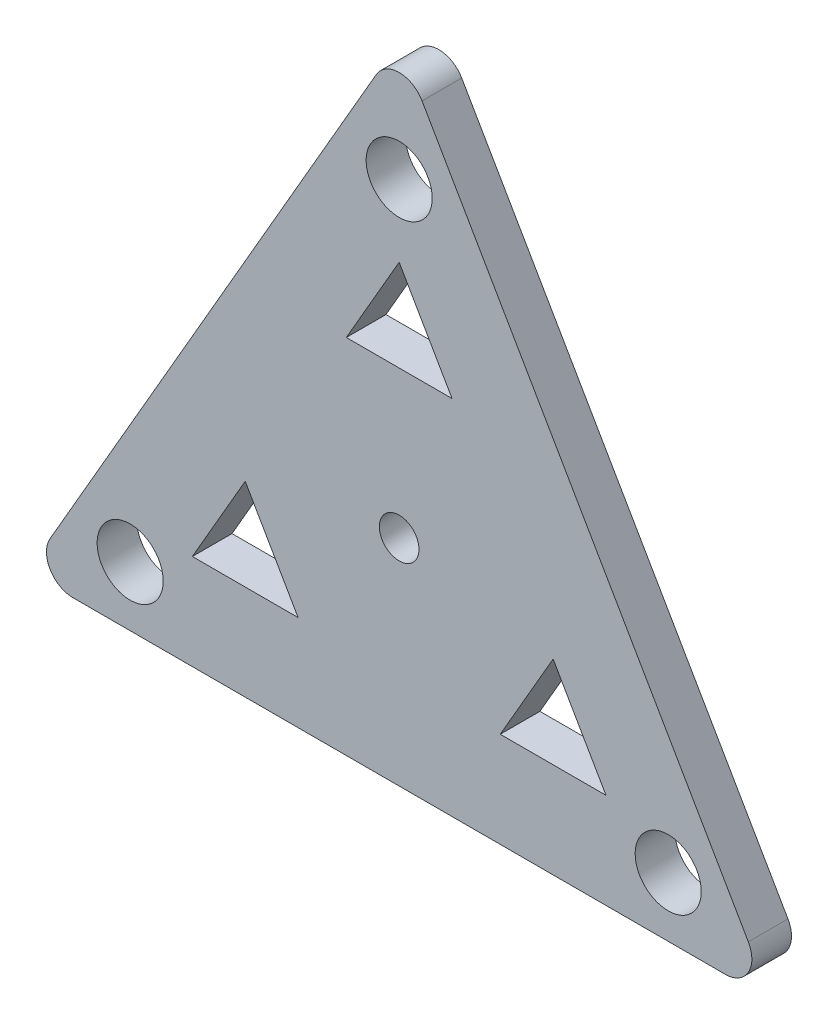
ISO-10303-21;
HEADER;
FILE_DESCRIPTION(('STEP AP214'),'2;1');
FILE_NAME('part.step','',(''),(''),'','','');
FILE_SCHEMA(('AUTOMOTIVE_DESIGN { 1 0 10303 214 1 1 1 1 }'));
ENDSEC;
DATA;
#1=APPLICATION_CONTEXT('core data for automotive mechanical design processes');
#2=APPLICATION_PROTOCOL_DEFINITION('international standard','automotive_design',2000,#1);
#3=PRODUCT_CONTEXT('',#1,'mechanical');
#4=PRODUCT('Part','Part','',(#3));
#5=PRODUCT_RELATED_PRODUCT_CATEGORY('part','',(#4));
#6=PRODUCT_DEFINITION_FORMATION('','',#4);
#7=PRODUCT_DEFINITION_CONTEXT('part definition',#1,'design');
#8=PRODUCT_DEFINITION('design','',#6,#7);
#9=PRODUCT_DEFINITION_SHAPE('','',#8);
#10=(LENGTH_UNIT() NAMED_UNIT(*) SI_UNIT(.MILLI.,.METRE.));
#11=(NAMED_UNIT(*) PLANE_ANGLE_UNIT() SI_UNIT($,.RADIAN.));
#12=(NAMED_UNIT(*) SI_UNIT($,.STERADIAN.) SOLID_ANGLE_UNIT());
#13=UNCERTAINTY_MEASURE_WITH_UNIT(LENGTH_MEASURE(1.E-05),#10,'distance_accuracy_value','');
#14=(GEOMETRIC_REPRESENTATION_CONTEXT(3) GLOBAL_UNCERTAINTY_ASSIGNED_CONTEXT((#13)) GLOBAL_UNIT_ASSIGNED_CONTEXT((#10,
#11,#12)) REPRESENTATION_CONTEXT('',''));
#15=CARTESIAN_POINT('',(0.,0.,0.));
#16=DIRECTION('',(0.,0.,1.));
#17=DIRECTION('',(1.,0.,0.));
#18=AXIS2_PLACEMENT_3D('',#15,#16,#17);
#19=CARTESIAN_POINT('',(28.1458256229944,-16.2500000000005,3.));
#20=DIRECTION('',(-0.866025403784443,-0.499999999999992,0.));
#21=DIRECTION('',(0.499999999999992,-0.866025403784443,0.));
#22=AXIS2_PLACEMENT_3D('',#19,#20,#21);
#23=PLANE('',#22);
#24=DIRECTION('',(-0.499999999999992,0.866025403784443,0.));
#25=VECTOR('',#24,1.);
#26=CARTESIAN_POINT('',(28.1458256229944,-16.2500000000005,3.));
#27=LINE('',#26,#25);
#28=CARTESIAN_POINT('',(26.4137748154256,-13.2500000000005,3.));
#29=VERTEX_POINT('',#28);
#30=CARTESIAN_POINT('',(1.73205080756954,29.4999999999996,3.));
#31=VERTEX_POINT('',#30);
#32=EDGE_CURVE('E245',#29,#31,#27,.T.);
#33=ORIENTED_EDGE('',*,*,#32,.F.);
#34=DIRECTION('',(0.,0.,-1.));
#35=VECTOR('',#34,1.);
#36=CARTESIAN_POINT('',(26.4137748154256,-13.2500000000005,3.));
#37=LINE('',#36,#35);
#38=CARTESIAN_POINT('',(26.4137748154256,-13.2500000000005,0.));
#39=VERTEX_POINT('',#38);
#40=EDGE_CURVE('E264',#29,#39,#37,.T.);
#41=ORIENTED_EDGE('',*,*,#40,.T.);
#42=DIRECTION('',(-0.499999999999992,0.866025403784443,0.));
#43=VECTOR('',#42,1.);
#44=CARTESIAN_POINT('',(28.1458256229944,-16.2500000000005,0.));
#45=LINE('',#44,#43);
#46=CARTESIAN_POINT('',(1.73205080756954,29.4999999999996,0.));
#47=VERTEX_POINT('',#46);
#48=EDGE_CURVE('E230',#39,#47,#45,.T.);
#49=ORIENTED_EDGE('',*,*,#48,.T.);
#50=DIRECTION('',(0.,0.,-1.));
#51=VECTOR('',#50,1.);
#52=CARTESIAN_POINT('',(1.73205080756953,29.4999999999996,3.));
#53=LINE('',#52,#51);
#54=EDGE_CURVE('E255',#47,#31,#53,.F.);
#55=ORIENTED_EDGE('',*,*,#54,.T.);
#56=EDGE_LOOP('',(#33,#41,#49,#55));
#57=FACE_BOUND('',#56,.T.);
#58=ADVANCED_FACE('F41',(#57),#23,.F.);
#59=CARTESIAN_POINT('',(6.74313992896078E-13,32.4999999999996,3.));
#60=DIRECTION('',(0.866025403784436,-0.500000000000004,0.));
#61=DIRECTION('',(0.500000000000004,0.866025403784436,0.));
#62=AXIS2_PLACEMENT_3D('',#59,#60,#61);
#63=PLANE('',#62);
#64=DIRECTION('',(-0.500000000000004,-0.866025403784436,0.));
#65=VECTOR('',#64,1.);
#66=CARTESIAN_POINT('',(6.74313992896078E-13,32.4999999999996,0.));
#67=LINE('',#66,#65);
#68=CARTESIAN_POINT('',(-1.73205080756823,29.4999999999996,0.));
#69=VERTEX_POINT('',#68);
#70=CARTESIAN_POINT('',(-26.4137748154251,-13.2500000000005,0.));
#71=VERTEX_POINT('',#70);
#72=EDGE_CURVE('E258',#69,#71,#67,.T.);
#73=ORIENTED_EDGE('',*,*,#72,.T.);
#74=DIRECTION('',(0.,0.,-1.));
#75=VECTOR('',#74,1.);
#76=CARTESIAN_POINT('',(-26.4137748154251,-13.2500000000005,3.));
#77=LINE('',#76,#75);
#78=CARTESIAN_POINT('',(-26.4137748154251,-13.2500000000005,3.));
#79=VERTEX_POINT('',#78);
#80=EDGE_CURVE('E11',#71,#79,#77,.F.);
#81=ORIENTED_EDGE('',*,*,#80,.T.);
#82=DIRECTION('',(-0.500000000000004,-0.866025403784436,0.));
#83=VECTOR('',#82,1.);
#84=CARTESIAN_POINT('',(6.74313992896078E-13,32.4999999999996,3.));
#85=LINE('',#84,#83);
#86=CARTESIAN_POINT('',(-1.73205080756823,29.4999999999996,3.));
#87=VERTEX_POINT('',#86);
#88=EDGE_CURVE('E248',#87,#79,#85,.T.);
#89=ORIENTED_EDGE('',*,*,#88,.F.);
#90=DIRECTION('',(0.,0.,-1.));
#91=VECTOR('',#90,1.);
#92=CARTESIAN_POINT('',(-1.73205080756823,29.4999999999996,3.));
#93=LINE('',#92,#91);
#94=EDGE_CURVE('E50',#87,#69,#93,.T.);
#95=ORIENTED_EDGE('',*,*,#94,.T.);
#96=EDGE_LOOP('',(#73,#81,#89,#95));
#97=FACE_BOUND('',#96,.T.);
#98=ADVANCED_FACE('F289',(#97),#63,.F.);
#99=CARTESIAN_POINT('',(-28.145825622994,-16.2500000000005,3.));
#100=DIRECTION('',(0.,1.,0.));
#101=DIRECTION('',(0.,0.,1.));
#102=AXIS2_PLACEMENT_3D('',#99,#100,#101);
#103=PLANE('',#102);
#104=DIRECTION('',(1.,0.,0.));
#105=VECTOR('',#104,1.);
#106=CARTESIAN_POINT('',(-28.145825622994,-16.2500000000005,0.));
#107=LINE('',#106,#105);
#108=CARTESIAN_POINT('',(-24.6817240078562,-16.2500000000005,0.));
#109=VERTEX_POINT('',#108);
#110=CARTESIAN_POINT('',(24.6817240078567,-16.2500000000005,0.));
#111=VERTEX_POINT('',#110);
#112=EDGE_CURVE('E249',#109,#111,#107,.T.);
#113=ORIENTED_EDGE('',*,*,#112,.T.);
#114=DIRECTION('',(0.,0.,-1.));
#115=VECTOR('',#114,1.);
#116=CARTESIAN_POINT('',(24.6817240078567,-16.2500000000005,3.));
#117=LINE('',#116,#115);
#118=CARTESIAN_POINT('',(24.6817240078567,-16.2500000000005,3.));
#119=VERTEX_POINT('',#118);
#120=EDGE_CURVE('E276',#111,#119,#117,.F.);
#121=ORIENTED_EDGE('',*,*,#120,.T.);
#122=DIRECTION('',(1.,0.,0.));
#123=VECTOR('',#122,1.);
#124=CARTESIAN_POINT('',(-28.145825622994,-16.2500000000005,3.));
#125=LINE('',#124,#123);
#126=CARTESIAN_POINT('',(-24.6817240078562,-16.2500000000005,3.));
#127=VERTEX_POINT('',#126);
#128=EDGE_CURVE('E252',#127,#119,#125,.T.);
#129=ORIENTED_EDGE('',*,*,#128,.F.);
#130=DIRECTION('',(0.,0.,-1.));
#131=VECTOR('',#130,1.);
#132=CARTESIAN_POINT('',(-24.6817240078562,-16.2500000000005,3.));
#133=LINE('',#132,#131);
#134=EDGE_CURVE('E273',#127,#109,#133,.T.);
#135=ORIENTED_EDGE('',*,*,#134,.T.);
#136=EDGE_LOOP('',(#113,#121,#129,#135));
#137=FACE_BOUND('',#136,.T.);
#138=ADVANCED_FACE('F302',(#137),#103,.F.);
#139=CARTESIAN_POINT('',(0.,0.,3.));
#140=DIRECTION('',(0.,0.,1.));
#141=DIRECTION('',(1.,0.,0.));
#142=AXIS2_PLACEMENT_3D('',#139,#140,#141);
#143=PLANE('',#142);
#144=CARTESIAN_POINT('',(0.,0.,3.));
#145=DIRECTION('',(0.,0.,1.));
#146=DIRECTION('',(1.,0.,0.));
#147=AXIS2_PLACEMENT_3D('',#144,#145,#146);
#148=CIRCLE('',#147,1.5);
#149=CARTESIAN_POINT('',(1.5,0.,3.));
#150=VERTEX_POINT('',#149);
#151=EDGE_CURVE('E172',#150,#150,#148,.T.);
#152=ORIENTED_EDGE('',*,*,#151,.F.);
#153=EDGE_LOOP('',(#152));
#154=FACE_BOUND('',#153,.T.);
#155=DIRECTION('',(-0.500000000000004,0.866025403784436,0.));
#156=VECTOR('',#155,1.);
#157=CARTESIAN_POINT('',(4.,11.1390432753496,3.));
#158=LINE('',#157,#156);
#159=CARTESIAN_POINT('',(4.,11.1390432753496,3.));
#160=VERTEX_POINT('',#159);
#161=CARTESIAN_POINT('',(0.,18.067246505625,3.));
#162=VERTEX_POINT('',#161);
#163=EDGE_CURVE('E57',#160,#162,#158,.T.);
#164=ORIENTED_EDGE('',*,*,#163,.F.);
#165=DIRECTION('',(1.,0.,0.));
#166=VECTOR('',#165,1.);
#167=CARTESIAN_POINT('',(-4.,11.1390432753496,3.));
#168=LINE('',#167,#166);
#169=CARTESIAN_POINT('',(-4.,11.1390432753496,3.));
#170=VERTEX_POINT('',#169);
#171=EDGE_CURVE('E166',#170,#160,#168,.T.);
#172=ORIENTED_EDGE('',*,*,#171,.F.);
#173=DIRECTION('',(-0.500000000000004,-0.866025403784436,0.));
#174=VECTOR('',#173,1.);
#175=CARTESIAN_POINT('',(0.,18.067246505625,3.));
#176=LINE('',#175,#174);
#177=EDGE_CURVE('E169',#162,#170,#176,.T.);
#178=ORIENTED_EDGE('',*,*,#177,.F.);
#179=EDGE_LOOP('',(#164,#172,#178));
#180=FACE_BOUND('',#179,.T.);
#181=DIRECTION('',(-0.499999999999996,-0.866025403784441,0.));
#182=VECTOR('',#181,1.);
#183=CARTESIAN_POINT('',(-15.6466944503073,-9.03362325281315,3.));
#184=LINE('',#183,#182);
#185=CARTESIAN_POINT('',(-11.6466944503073,-2.10542002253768,3.));
#186=VERTEX_POINT('',#185);
#187=CARTESIAN_POINT('',(-15.6466944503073,-9.03362325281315,3.));
#188=VERTEX_POINT('',#187);
#189=EDGE_CURVE('E65',#186,#188,#184,.T.);
#190=ORIENTED_EDGE('',*,*,#189,.F.);
#191=DIRECTION('',(-0.5,0.866025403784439,0.));
#192=VECTOR('',#191,1.);
#193=CARTESIAN_POINT('',(-11.6466944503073,-2.10542002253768,3.));
#194=LINE('',#193,#192);
#195=CARTESIAN_POINT('',(-7.64669445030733,-9.03362325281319,3.));
#196=VERTEX_POINT('',#195);
#197=EDGE_CURVE('E189',#196,#186,#194,.T.);
#198=ORIENTED_EDGE('',*,*,#197,.F.);
#199=DIRECTION('',(1.,0.,0.));
#200=VECTOR('',#199,1.);
#201=CARTESIAN_POINT('',(-7.64669445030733,-9.03362325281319,3.));
#202=LINE('',#201,#200);
#203=EDGE_CURVE('E192',#188,#196,#202,.T.);
#204=ORIENTED_EDGE('',*,*,#203,.F.);
#205=EDGE_LOOP('',(#190,#198,#204));
#206=FACE_BOUND('',#205,.T.);
#207=DIRECTION('',(1.,0.,0.));
#208=VECTOR('',#207,1.);
#209=CARTESIAN_POINT('',(15.6466944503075,-9.03362325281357,3.));
#210=LINE('',#209,#208);
#211=CARTESIAN_POINT('',(7.64669445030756,-9.03362325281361,3.));
#212=VERTEX_POINT('',#211);
#213=CARTESIAN_POINT('',(15.6466944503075,-9.03362325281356,3.));
#214=VERTEX_POINT('',#213);
#215=EDGE_CURVE('E188',#212,#214,#210,.T.);
#216=ORIENTED_EDGE('',*,*,#215,.F.);
#217=DIRECTION('',(-0.5,-0.866025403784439,0.));
#218=VECTOR('',#217,1.);
#219=CARTESIAN_POINT('',(7.64669445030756,-9.03362325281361,3.));
#220=LINE('',#219,#218);
#221=CARTESIAN_POINT('',(11.6466944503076,-2.1054200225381,3.));
#222=VERTEX_POINT('',#221);
#223=EDGE_CURVE('E212',#222,#212,#220,.T.);
#224=ORIENTED_EDGE('',*,*,#223,.F.);
#225=DIRECTION('',(-0.499999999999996,0.866025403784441,0.));
#226=VECTOR('',#225,1.);
#227=CARTESIAN_POINT('',(11.6466944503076,-2.1054200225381,3.));
#228=LINE('',#227,#226);
#229=EDGE_CURVE('E215',#214,#222,#228,.T.);
#230=ORIENTED_EDGE('',*,*,#229,.F.);
#231=EDGE_LOOP('',(#216,#224,#230));
#232=FACE_BOUND('',#231,.T.);
#233=CARTESIAN_POINT('',(0.,23.5,3.));
#234=DIRECTION('',(0.,0.,1.));
#235=DIRECTION('',(1.,0.,0.));
#236=AXIS2_PLACEMENT_3D('',#233,#234,#235);
#237=CIRCLE('',#236,2.5);
#238=CARTESIAN_POINT('',(2.5,23.5,3.));
#239=VERTEX_POINT('',#238);
#240=EDGE_CURVE('E231',#239,#239,#237,.T.);
#241=ORIENTED_EDGE('',*,*,#240,.F.);
#242=EDGE_LOOP('',(#241));
#243=FACE_BOUND('',#242,.T.);
#244=CARTESIAN_POINT('',(-20.3515969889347,-11.7500000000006,3.));
#245=DIRECTION('',(0.,0.,1.));
#246=DIRECTION('',(-1.,0.,0.));
#247=AXIS2_PLACEMENT_3D('',#244,#245,#246);
#248=CIRCLE('',#247,2.49999999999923);
#249=CARTESIAN_POINT('',(-22.8515969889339,-11.7500000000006,3.));
#250=VERTEX_POINT('',#249);
#251=EDGE_CURVE('E234',#250,#250,#248,.T.);
#252=ORIENTED_EDGE('',*,*,#251,.F.);
#253=EDGE_LOOP('',(#252));
#254=FACE_BOUND('',#253,.T.);
#255=CARTESIAN_POINT('',(20.3515969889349,-11.750000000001,3.));
#256=DIRECTION('',(0.,0.,1.));
#257=DIRECTION('',(-1.,0.,0.));
#258=AXIS2_PLACEMENT_3D('',#255,#256,#257);
#259=CIRCLE('',#258,2.49999999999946);
#260=CARTESIAN_POINT('',(17.8515969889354,-11.750000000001,3.));
#261=VERTEX_POINT('',#260);
#262=EDGE_CURVE('E240',#261,#261,#259,.T.);
#263=ORIENTED_EDGE('',*,*,#262,.F.);
#264=EDGE_LOOP('',(#263));
#265=FACE_BOUND('',#264,.T.);
#266=ORIENTED_EDGE('',*,*,#128,.T.);
#267=CARTESIAN_POINT('',(24.6817240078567,-14.2500000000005,3.));
#268=DIRECTION('',(0.,0.,1.));
#269=DIRECTION('',(1.,0.,0.));
#270=AXIS2_PLACEMENT_3D('',#267,#268,#269);
#271=CIRCLE('',#270,2.);
#272=EDGE_CURVE('E282',#119,#29,#271,.T.);
#273=ORIENTED_EDGE('',*,*,#272,.T.);
#274=ORIENTED_EDGE('',*,*,#32,.T.);
#275=CARTESIAN_POINT('',(6.41630845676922E-13,28.4999999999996,3.));
#276=DIRECTION('',(0.,0.,1.));
#277=DIRECTION('',(1.,0.,0.));
#278=AXIS2_PLACEMENT_3D('',#275,#276,#277);
#279=CIRCLE('',#278,2.);
#280=EDGE_CURVE('E278',#31,#87,#279,.T.);
#281=ORIENTED_EDGE('',*,*,#280,.T.);
#282=ORIENTED_EDGE('',*,*,#88,.T.);
#283=CARTESIAN_POINT('',(-24.6817240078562,-14.2500000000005,3.));
#284=DIRECTION('',(0.,0.,1.));
#285=DIRECTION('',(1.,0.,0.));
#286=AXIS2_PLACEMENT_3D('',#283,#284,#285);
#287=CIRCLE('',#286,2.);
#288=EDGE_CURVE('E280',#79,#127,#287,.T.);
#289=ORIENTED_EDGE('',*,*,#288,.T.);
#290=EDGE_LOOP('',(#266,#273,#274,#281,#282,#289));
#291=FACE_BOUND('',#290,.T.);
#292=ADVANCED_FACE('F306',(#154,#180,#206,#232,#243,#254,#265,#291),#143,.T.);
#293=CARTESIAN_POINT('',(0.,0.,0.));
#294=DIRECTION('',(0.,0.,1.));
#295=DIRECTION('',(1.,0.,0.));
#296=AXIS2_PLACEMENT_3D('',#293,#294,#295);
#297=PLANE('',#296);
#298=CARTESIAN_POINT('',(0.,0.,0.));
#299=DIRECTION('',(0.,0.,1.));
#300=DIRECTION('',(1.,0.,0.));
#301=AXIS2_PLACEMENT_3D('',#298,#299,#300);
#302=CIRCLE('',#301,1.5);
#303=CARTESIAN_POINT('',(1.5,0.,0.));
#304=VERTEX_POINT('',#303);
#305=EDGE_CURVE('E45',#304,#304,#302,.T.);
#306=ORIENTED_EDGE('',*,*,#305,.T.);
#307=EDGE_LOOP('',(#306));
#308=FACE_BOUND('',#307,.T.);
#309=DIRECTION('',(1.,0.,0.));
#310=VECTOR('',#309,1.);
#311=CARTESIAN_POINT('',(-4.,11.1390432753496,0.));
#312=LINE('',#311,#310);
#313=CARTESIAN_POINT('',(-4.,11.1390432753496,0.));
#314=VERTEX_POINT('',#313);
#315=CARTESIAN_POINT('',(4.,11.1390432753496,0.));
#316=VERTEX_POINT('',#315);
#317=EDGE_CURVE('E156',#314,#316,#312,.T.);
#318=ORIENTED_EDGE('',*,*,#317,.T.);
#319=DIRECTION('',(-0.500000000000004,0.866025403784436,0.));
#320=VECTOR('',#319,1.);
#321=CARTESIAN_POINT('',(4.,11.1390432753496,0.));
#322=LINE('',#321,#320);
#323=CARTESIAN_POINT('',(0.,18.067246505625,0.));
#324=VERTEX_POINT('',#323);
#325=EDGE_CURVE('E150',#316,#324,#322,.T.);
#326=ORIENTED_EDGE('',*,*,#325,.T.);
#327=DIRECTION('',(-0.500000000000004,-0.866025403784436,0.));
#328=VECTOR('',#327,1.);
#329=CARTESIAN_POINT('',(0.,18.067246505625,0.));
#330=LINE('',#329,#328);
#331=EDGE_CURVE('E160',#324,#314,#330,.T.);
#332=ORIENTED_EDGE('',*,*,#331,.T.);
#333=EDGE_LOOP('',(#318,#326,#332));
#334=FACE_BOUND('',#333,.T.);
#335=DIRECTION('',(-0.5,0.866025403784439,0.));
#336=VECTOR('',#335,1.);
#337=CARTESIAN_POINT('',(-11.6466944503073,-2.10542002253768,0.));
#338=LINE('',#337,#336);
#339=CARTESIAN_POINT('',(-7.64669445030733,-9.03362325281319,0.));
#340=VERTEX_POINT('',#339);
#341=CARTESIAN_POINT('',(-11.6466944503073,-2.10542002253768,0.));
#342=VERTEX_POINT('',#341);
#343=EDGE_CURVE('E183',#340,#342,#338,.T.);
#344=ORIENTED_EDGE('',*,*,#343,.T.);
#345=DIRECTION('',(-0.499999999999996,-0.866025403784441,0.));
#346=VECTOR('',#345,1.);
#347=CARTESIAN_POINT('',(-15.6466944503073,-9.03362325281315,0.));
#348=LINE('',#347,#346);
#349=CARTESIAN_POINT('',(-15.6466944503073,-9.03362325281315,0.));
#350=VERTEX_POINT('',#349);
#351=EDGE_CURVE('E193',#342,#350,#348,.T.);
#352=ORIENTED_EDGE('',*,*,#351,.T.);
#353=DIRECTION('',(1.,0.,0.));
#354=VECTOR('',#353,1.);
#355=CARTESIAN_POINT('',(-7.64669445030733,-9.03362325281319,0.));
#356=LINE('',#355,#354);
#357=EDGE_CURVE('E199',#350,#340,#356,.T.);
#358=ORIENTED_EDGE('',*,*,#357,.T.);
#359=EDGE_LOOP('',(#344,#352,#358));
#360=FACE_BOUND('',#359,.T.);
#361=DIRECTION('',(-0.5,-0.866025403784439,0.));
#362=VECTOR('',#361,1.);
#363=CARTESIAN_POINT('',(7.64669445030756,-9.03362325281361,0.));
#364=LINE('',#363,#362);
#365=CARTESIAN_POINT('',(11.6466944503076,-2.1054200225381,0.));
#366=VERTEX_POINT('',#365);
#367=CARTESIAN_POINT('',(7.64669445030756,-9.03362325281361,0.));
#368=VERTEX_POINT('',#367);
#369=EDGE_CURVE('E207',#366,#368,#364,.T.);
#370=ORIENTED_EDGE('',*,*,#369,.T.);
#371=DIRECTION('',(1.,0.,0.));
#372=VECTOR('',#371,1.);
#373=CARTESIAN_POINT('',(15.6466944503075,-9.03362325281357,0.));
#374=LINE('',#373,#372);
#375=CARTESIAN_POINT('',(15.6466944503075,-9.03362325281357,0.));
#376=VERTEX_POINT('',#375);
#377=EDGE_CURVE('E216',#368,#376,#374,.T.);
#378=ORIENTED_EDGE('',*,*,#377,.T.);
#379=DIRECTION('',(-0.499999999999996,0.866025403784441,0.));
#380=VECTOR('',#379,1.);
#381=CARTESIAN_POINT('',(11.6466944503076,-2.1054200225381,0.));
#382=LINE('',#381,#380);
#383=EDGE_CURVE('E222',#376,#366,#382,.T.);
#384=ORIENTED_EDGE('',*,*,#383,.T.);
#385=EDGE_LOOP('',(#370,#378,#384));
#386=FACE_BOUND('',#385,.T.);
#387=CARTESIAN_POINT('',(0.,23.5,0.));
#388=DIRECTION('',(0.,0.,1.));
#389=DIRECTION('',(1.,0.,0.));
#390=AXIS2_PLACEMENT_3D('',#387,#388,#389);
#391=CIRCLE('',#390,2.5);
#392=CARTESIAN_POINT('',(2.5,23.5,0.));
#393=VERTEX_POINT('',#392);
#394=EDGE_CURVE('E227',#393,#393,#391,.T.);
#395=ORIENTED_EDGE('',*,*,#394,.T.);
#396=EDGE_LOOP('',(#395));
#397=FACE_BOUND('',#396,.T.);
#398=CARTESIAN_POINT('',(-20.3515969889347,-11.7500000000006,0.));
#399=DIRECTION('',(0.,0.,1.));
#400=DIRECTION('',(-1.,0.,0.));
#401=AXIS2_PLACEMENT_3D('',#398,#399,#400);
#402=CIRCLE('',#401,2.49999999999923);
#403=CARTESIAN_POINT('',(-22.8515969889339,-11.7500000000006,0.));
#404=VERTEX_POINT('',#403);
#405=EDGE_CURVE('E237',#404,#404,#402,.T.);
#406=ORIENTED_EDGE('',*,*,#405,.T.);
#407=EDGE_LOOP('',(#406));
#408=FACE_BOUND('',#407,.T.);
#409=CARTESIAN_POINT('',(20.3515969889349,-11.750000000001,0.));
#410=DIRECTION('',(0.,0.,1.));
#411=DIRECTION('',(-1.,0.,0.));
#412=AXIS2_PLACEMENT_3D('',#409,#410,#411);
#413=CIRCLE('',#412,2.49999999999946);
#414=CARTESIAN_POINT('',(17.8515969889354,-11.750000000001,0.));
#415=VERTEX_POINT('',#414);
#416=EDGE_CURVE('E179',#415,#415,#413,.T.);
#417=ORIENTED_EDGE('',*,*,#416,.T.);
#418=EDGE_LOOP('',(#417));
#419=FACE_BOUND('',#418,.T.);
#420=ORIENTED_EDGE('',*,*,#48,.F.);
#421=CARTESIAN_POINT('',(24.6817240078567,-14.2500000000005,0.));
#422=DIRECTION('',(0.,0.,1.));
#423=DIRECTION('',(1.,0.,0.));
#424=AXIS2_PLACEMENT_3D('',#421,#422,#423);
#425=CIRCLE('',#424,2.);
#426=EDGE_CURVE('E271',#39,#111,#425,.F.);
#427=ORIENTED_EDGE('',*,*,#426,.T.);
#428=ORIENTED_EDGE('',*,*,#112,.F.);
#429=CARTESIAN_POINT('',(-24.6817240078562,-14.2500000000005,0.));
#430=DIRECTION('',(0.,0.,1.));
#431=DIRECTION('',(1.,0.,0.));
#432=AXIS2_PLACEMENT_3D('',#429,#430,#431);
#433=CIRCLE('',#432,2.);
#434=EDGE_CURVE('E269',#109,#71,#433,.F.);
#435=ORIENTED_EDGE('',*,*,#434,.T.);
#436=ORIENTED_EDGE('',*,*,#72,.F.);
#437=CARTESIAN_POINT('',(6.41630845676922E-13,28.4999999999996,0.));
#438=DIRECTION('',(0.,0.,1.));
#439=DIRECTION('',(1.,0.,0.));
#440=AXIS2_PLACEMENT_3D('',#437,#438,#439);
#441=CIRCLE('',#440,2.);
#442=EDGE_CURVE('E267',#69,#47,#441,.F.);
#443=ORIENTED_EDGE('',*,*,#442,.T.);
#444=EDGE_LOOP('',(#420,#427,#428,#435,#436,#443));
#445=FACE_BOUND('',#444,.T.);
#446=ADVANCED_FACE('F164',(#308,#334,#360,#386,#397,#408,#419,#445),#297,.F.);
#447=CARTESIAN_POINT('',(24.6817240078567,-14.2500000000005,3.));
#448=DIRECTION('',(0.,0.,-1.));
#449=DIRECTION('',(-1.,0.,0.));
#450=AXIS2_PLACEMENT_3D('',#447,#448,#449);
#451=CYLINDRICAL_SURFACE('',#450,2.);
#452=ORIENTED_EDGE('',*,*,#272,.F.);
#453=ORIENTED_EDGE('',*,*,#120,.F.);
#454=ORIENTED_EDGE('',*,*,#426,.F.);
#455=ORIENTED_EDGE('',*,*,#40,.F.);
#456=EDGE_LOOP('',(#452,#453,#454,#455));
#457=FACE_BOUND('',#456,.T.);
#458=ADVANCED_FACE('F310',(#457),#451,.T.);
#459=CARTESIAN_POINT('',(-24.6817240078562,-14.2500000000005,3.));
#460=DIRECTION('',(0.,0.,-1.));
#461=DIRECTION('',(-1.,0.,0.));
#462=AXIS2_PLACEMENT_3D('',#459,#460,#461);
#463=CYLINDRICAL_SURFACE('',#462,2.);
#464=ORIENTED_EDGE('',*,*,#288,.F.);
#465=ORIENTED_EDGE('',*,*,#80,.F.);
#466=ORIENTED_EDGE('',*,*,#434,.F.);
#467=ORIENTED_EDGE('',*,*,#134,.F.);
#468=EDGE_LOOP('',(#464,#465,#466,#467));
#469=FACE_BOUND('',#468,.T.);
#470=ADVANCED_FACE('F299',(#469),#463,.T.);
#471=CARTESIAN_POINT('',(6.41630845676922E-13,28.4999999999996,3.));
#472=DIRECTION('',(0.,0.,-1.));
#473=DIRECTION('',(-1.,0.,0.));
#474=AXIS2_PLACEMENT_3D('',#471,#472,#473);
#475=CYLINDRICAL_SURFACE('',#474,2.);
#476=ORIENTED_EDGE('',*,*,#280,.F.);
#477=ORIENTED_EDGE('',*,*,#54,.F.);
#478=ORIENTED_EDGE('',*,*,#442,.F.);
#479=ORIENTED_EDGE('',*,*,#94,.F.);
#480=EDGE_LOOP('',(#476,#477,#478,#479));
#481=FACE_BOUND('',#480,.T.);
#482=ADVANCED_FACE('F43',(#481),#475,.T.);
#483=CARTESIAN_POINT('',(20.3515969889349,-11.750000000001,0.));
#484=DIRECTION('',(0.,0.,1.));
#485=DIRECTION('',(1.,0.,0.));
#486=AXIS2_PLACEMENT_3D('',#483,#484,#485);
#487=CYLINDRICAL_SURFACE('',#486,2.49999999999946);
#488=ORIENTED_EDGE('',*,*,#416,.F.);
#489=EDGE_LOOP('',(#488));
#490=FACE_BOUND('',#489,.T.);
#491=ORIENTED_EDGE('',*,*,#262,.T.);
#492=EDGE_LOOP('',(#491));
#493=FACE_BOUND('',#492,.T.);
#494=ADVANCED_FACE('F314',(#490,#493),#487,.F.);
#495=CARTESIAN_POINT('',(-20.3515969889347,-11.7500000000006,0.));
#496=DIRECTION('',(0.,0.,1.));
#497=DIRECTION('',(1.,0.,0.));
#498=AXIS2_PLACEMENT_3D('',#495,#496,#497);
#499=CYLINDRICAL_SURFACE('',#498,2.49999999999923);
#500=ORIENTED_EDGE('',*,*,#405,.F.);
#501=EDGE_LOOP('',(#500));
#502=FACE_BOUND('',#501,.T.);
#503=ORIENTED_EDGE('',*,*,#251,.T.);
#504=EDGE_LOOP('',(#503));
#505=FACE_BOUND('',#504,.T.);
#506=ADVANCED_FACE('F319',(#502,#505),#499,.F.);
#507=CARTESIAN_POINT('',(0.,23.5,0.));
#508=DIRECTION('',(0.,0.,1.));
#509=DIRECTION('',(1.,0.,0.));
#510=AXIS2_PLACEMENT_3D('',#507,#508,#509);
#511=CYLINDRICAL_SURFACE('',#510,2.5);
#512=ORIENTED_EDGE('',*,*,#394,.F.);
#513=EDGE_LOOP('',(#512));
#514=FACE_BOUND('',#513,.T.);
#515=ORIENTED_EDGE('',*,*,#240,.T.);
#516=EDGE_LOOP('',(#515));
#517=FACE_BOUND('',#516,.T.);
#518=ADVANCED_FACE('F392',(#514,#517),#511,.F.);
#519=CARTESIAN_POINT('',(15.6466944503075,-9.03362325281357,0.));
#520=DIRECTION('',(0.,-1.,0.));
#521=DIRECTION('',(1.,0.,0.));
#522=AXIS2_PLACEMENT_3D('',#519,#520,#521);
#523=PLANE('',#522);
#524=ORIENTED_EDGE('',*,*,#215,.T.);
#525=DIRECTION('',(0.,0.,1.));
#526=VECTOR('',#525,1.);
#527=CARTESIAN_POINT('',(15.6466944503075,-9.03362325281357,0.));
#528=LINE('',#527,#526);
#529=EDGE_CURVE('E204',#376,#214,#528,.T.);
#530=ORIENTED_EDGE('',*,*,#529,.F.);
#531=ORIENTED_EDGE('',*,*,#377,.F.);
#532=DIRECTION('',(0.,0.,1.));
#533=VECTOR('',#532,1.);
#534=CARTESIAN_POINT('',(7.64669445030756,-9.03362325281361,0.));
#535=LINE('',#534,#533);
#536=EDGE_CURVE('E210',#368,#212,#535,.T.);
#537=ORIENTED_EDGE('',*,*,#536,.T.);
#538=EDGE_LOOP('',(#524,#530,#531,#537));
#539=FACE_BOUND('',#538,.T.);
#540=ADVANCED_FACE('F401',(#539),#523,.F.);
#541=CARTESIAN_POINT('',(7.64669445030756,-9.03362325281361,0.));
#542=DIRECTION('',(-0.866025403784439,0.5,0.));
#543=DIRECTION('',(-0.5,-0.866025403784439,0.));
#544=AXIS2_PLACEMENT_3D('',#541,#542,#543);
#545=PLANE('',#544);
#546=ORIENTED_EDGE('',*,*,#223,.T.);
#547=ORIENTED_EDGE('',*,*,#536,.F.);
#548=ORIENTED_EDGE('',*,*,#369,.F.);
#549=DIRECTION('',(0.,0.,1.));
#550=VECTOR('',#549,1.);
#551=CARTESIAN_POINT('',(11.6466944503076,-2.1054200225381,0.));
#552=LINE('',#551,#550);
#553=EDGE_CURVE('E208',#366,#222,#552,.T.);
#554=ORIENTED_EDGE('',*,*,#553,.T.);
#555=EDGE_LOOP('',(#546,#547,#548,#554));
#556=FACE_BOUND('',#555,.T.);
#557=ADVANCED_FACE('F410',(#556),#545,.F.);
#558=CARTESIAN_POINT('',(11.6466944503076,-2.1054200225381,0.));
#559=DIRECTION('',(0.866025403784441,0.499999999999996,0.));
#560=DIRECTION('',(-0.499999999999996,0.866025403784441,0.));
#561=AXIS2_PLACEMENT_3D('',#558,#559,#560);
#562=PLANE('',#561);
#563=ORIENTED_EDGE('',*,*,#229,.T.);
#564=ORIENTED_EDGE('',*,*,#553,.F.);
#565=ORIENTED_EDGE('',*,*,#383,.F.);
#566=ORIENTED_EDGE('',*,*,#529,.T.);
#567=EDGE_LOOP('',(#563,#564,#565,#566));
#568=FACE_BOUND('',#567,.T.);
#569=ADVANCED_FACE('F419',(#568),#562,.F.);
#570=CARTESIAN_POINT('',(-15.6466944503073,-9.03362325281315,0.));
#571=DIRECTION('',(-0.866025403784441,0.499999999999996,0.));
#572=DIRECTION('',(-0.499999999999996,-0.866025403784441,0.));
#573=AXIS2_PLACEMENT_3D('',#570,#571,#572);
#574=PLANE('',#573);
#575=ORIENTED_EDGE('',*,*,#189,.T.);
#576=DIRECTION('',(0.,0.,1.));
#577=VECTOR('',#576,1.);
#578=CARTESIAN_POINT('',(-15.6466944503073,-9.03362325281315,0.));
#579=LINE('',#578,#577);
#580=EDGE_CURVE('E181',#350,#188,#579,.T.);
#581=ORIENTED_EDGE('',*,*,#580,.F.);
#582=ORIENTED_EDGE('',*,*,#351,.F.);
#583=DIRECTION('',(0.,0.,1.));
#584=VECTOR('',#583,1.);
#585=CARTESIAN_POINT('',(-11.6466944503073,-2.10542002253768,0.));
#586=LINE('',#585,#584);
#587=EDGE_CURVE('E186',#342,#186,#586,.T.);
#588=ORIENTED_EDGE('',*,*,#587,.T.);
#589=EDGE_LOOP('',(#575,#581,#582,#588));
#590=FACE_BOUND('',#589,.T.);
#591=ADVANCED_FACE('F428',(#590),#574,.F.);
#592=CARTESIAN_POINT('',(-11.6466944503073,-2.10542002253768,0.));
#593=DIRECTION('',(0.866025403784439,0.5,0.));
#594=DIRECTION('',(-0.5,0.866025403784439,0.));
#595=AXIS2_PLACEMENT_3D('',#592,#593,#594);
#596=PLANE('',#595);
#597=ORIENTED_EDGE('',*,*,#197,.T.);
#598=ORIENTED_EDGE('',*,*,#587,.F.);
#599=ORIENTED_EDGE('',*,*,#343,.F.);
#600=DIRECTION('',(0.,0.,1.));
#601=VECTOR('',#600,1.);
#602=CARTESIAN_POINT('',(-7.64669445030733,-9.03362325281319,0.));
#603=LINE('',#602,#601);
#604=EDGE_CURVE('E184',#340,#196,#603,.T.);
#605=ORIENTED_EDGE('',*,*,#604,.T.);
#606=EDGE_LOOP('',(#597,#598,#599,#605));
#607=FACE_BOUND('',#606,.T.);
#608=ADVANCED_FACE('F437',(#607),#596,.F.);
#609=CARTESIAN_POINT('',(-7.64669445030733,-9.03362325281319,0.));
#610=DIRECTION('',(0.,-1.,0.));
#611=DIRECTION('',(1.,0.,0.));
#612=AXIS2_PLACEMENT_3D('',#609,#610,#611);
#613=PLANE('',#612);
#614=ORIENTED_EDGE('',*,*,#203,.T.);
#615=ORIENTED_EDGE('',*,*,#604,.F.);
#616=ORIENTED_EDGE('',*,*,#357,.F.);
#617=ORIENTED_EDGE('',*,*,#580,.T.);
#618=EDGE_LOOP('',(#614,#615,#616,#617));
#619=FACE_BOUND('',#618,.T.);
#620=ADVANCED_FACE('F445',(#619),#613,.F.);
#621=CARTESIAN_POINT('',(4.,11.1390432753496,0.));
#622=DIRECTION('',(0.866025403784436,0.500000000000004,0.));
#623=DIRECTION('',(-0.500000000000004,0.866025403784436,0.));
#624=AXIS2_PLACEMENT_3D('',#621,#622,#623);
#625=PLANE('',#624);
#626=ORIENTED_EDGE('',*,*,#163,.T.);
#627=DIRECTION('',(0.,0.,1.));
#628=VECTOR('',#627,1.);
#629=CARTESIAN_POINT('',(0.,18.067246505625,0.));
#630=LINE('',#629,#628);
#631=EDGE_CURVE('E146',#324,#162,#630,.T.);
#632=ORIENTED_EDGE('',*,*,#631,.F.);
#633=ORIENTED_EDGE('',*,*,#325,.F.);
#634=DIRECTION('',(0.,0.,1.));
#635=VECTOR('',#634,1.);
#636=CARTESIAN_POINT('',(4.,11.1390432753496,0.));
#637=LINE('',#636,#635);
#638=EDGE_CURVE('E177',#316,#160,#637,.T.);
#639=ORIENTED_EDGE('',*,*,#638,.T.);
#640=EDGE_LOOP('',(#626,#632,#633,#639));
#641=FACE_BOUND('',#640,.T.);
#642=ADVANCED_FACE('F148',(#641),#625,.F.);
#643=CARTESIAN_POINT('',(-4.,11.1390432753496,0.));
#644=DIRECTION('',(0.,-1.,0.));
#645=DIRECTION('',(0.,0.,-1.));
#646=AXIS2_PLACEMENT_3D('',#643,#644,#645);
#647=PLANE('',#646);
#648=ORIENTED_EDGE('',*,*,#171,.T.);
#649=ORIENTED_EDGE('',*,*,#638,.F.);
#650=ORIENTED_EDGE('',*,*,#317,.F.);
#651=DIRECTION('',(0.,0.,1.));
#652=VECTOR('',#651,1.);
#653=CARTESIAN_POINT('',(-4.,11.1390432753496,0.));
#654=LINE('',#653,#652);
#655=EDGE_CURVE('E155',#314,#170,#654,.T.);
#656=ORIENTED_EDGE('',*,*,#655,.T.);
#657=EDGE_LOOP('',(#648,#649,#650,#656));
#658=FACE_BOUND('',#657,.T.);
#659=ADVANCED_FACE('F462',(#658),#647,.F.);
#660=CARTESIAN_POINT('',(0.,18.067246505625,0.));
#661=DIRECTION('',(-0.866025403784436,0.500000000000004,0.));
#662=DIRECTION('',(-0.500000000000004,-0.866025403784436,0.));
#663=AXIS2_PLACEMENT_3D('',#660,#661,#662);
#664=PLANE('',#663);
#665=ORIENTED_EDGE('',*,*,#177,.T.);
#666=ORIENTED_EDGE('',*,*,#655,.F.);
#667=ORIENTED_EDGE('',*,*,#331,.F.);
#668=ORIENTED_EDGE('',*,*,#631,.T.);
#669=EDGE_LOOP('',(#665,#666,#667,#668));
#670=FACE_BOUND('',#669,.T.);
#671=ADVANCED_FACE('F161',(#670),#664,.F.);
#672=CARTESIAN_POINT('',(0.,0.,-7.));
#673=DIRECTION('',(0.,0.,1.));
#674=DIRECTION('',(1.,0.,0.));
#675=AXIS2_PLACEMENT_3D('',#672,#673,#674);
#676=CYLINDRICAL_SURFACE('',#675,1.5);
#677=ORIENTED_EDGE('',*,*,#151,.T.);
#678=EDGE_LOOP('',(#677));
#679=FACE_BOUND('',#678,.T.);
#680=ORIENTED_EDGE('',*,*,#305,.F.);
#681=EDGE_LOOP('',(#680));
#682=FACE_BOUND('',#681,.T.);
#683=ADVANCED_FACE('F478',(#679,#682),#676,.F.);
#684=CLOSED_SHELL('',(#58,#98,#138,#292,#446,#458,#470,#482,#494,#506,#518,#540,#557,#569,#591,
#608,#620,#642,#659,#671,#683));
#685=MANIFOLD_SOLID_BREP('B2',#684);
#686=ADVANCED_BREP_SHAPE_REPRESENTATION('',(#18,#685),#14);
#687=SHAPE_DEFINITION_REPRESENTATION(#9,#686);
ENDSEC;
END-ISO-10303-21;
